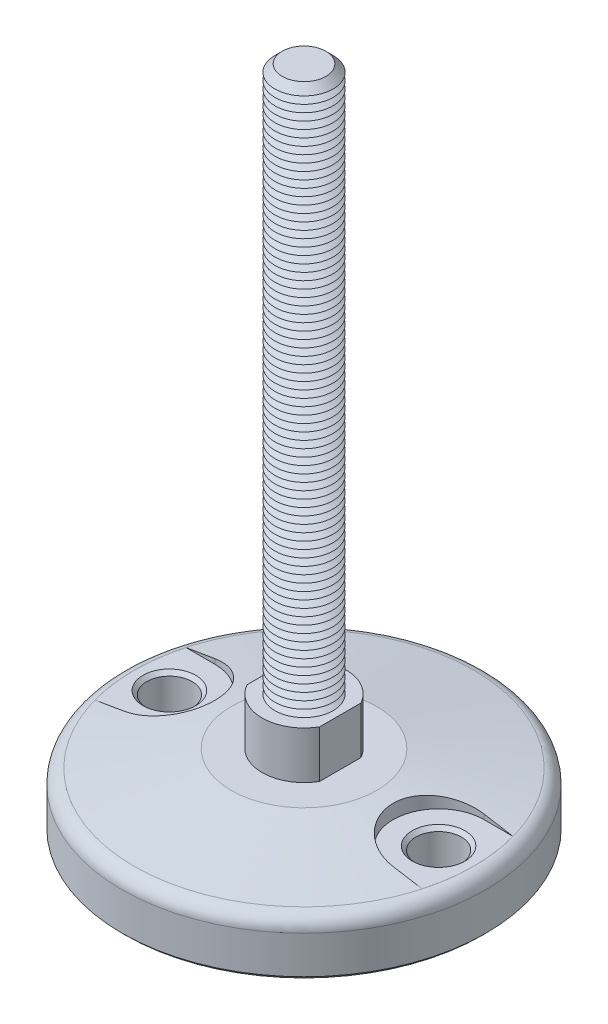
from build123d import *

# Parameters (mm, degrees)
FILLET1_R                = 4
SKETCH3_R                = 11.5
BOSS_EXTRUDE1_DEPTH      = 13
CUT_EXTRUDE1_START       = -13
CUT_EXTRUDE1_DEPTH       = 13
SKETCH5_R                = 8
BOSS_EXTRUDE2_DEPTH      = 150
CHAMFER1_SIZE            = 2
LPATTERN1_COUNT          = 74
LPATTERN1_PITCH          = 2
CUT_EXTRUDE4_DEPTH       = 4.7
SKETCH10_R               = 6.25
CUT_EXTRUDE5_DEPTH       = 15.3
CHAMFER2_SIZE            = 1
CHAMFER2_OF_MIRROR1_SIZE = 1
CHAMFER3_SIZE            = 1


with BuildPart() as part:
    # Sketch2 → Revolve1 (revolve)
    with BuildSketch(Plane(origin=(0, 0, 0), x_dir=(0, 0, -1), z_dir=(1, 0, 0))):
        Polygon((0, 0), (-20, 0), (-50, -5.289809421), (-50, -20), (0, -20), align=None)
    revolve(axis=Axis((0, 61.338865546, 0), (0, -1, 0)))

    # Fillet1
    fillet1_edges = [part.edges().sort_by_distance(p)[0] for p in [
        (0, -5.289809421, -50),
    ]]
    fillet(fillet1_edges, radius=FILLET1_R)

    # Sketch3 → Boss-Extrude1 (add)
    with BuildSketch(Plane(origin=(0, 0, 0), x_dir=(1, 0, 0), z_dir=(0, 1, 0))):
        with Locations(Location((0, 0, 0), (0, 0, 90))):
            Circle(SKETCH3_R)
    extrude(amount=BOSS_EXTRUDE1_DEPTH)

    # Sketch4 → Cut-Extrude1 (cut)
    with BuildSketch(Plane(origin=(0, 13, 0), x_dir=(1, 0, 0), z_dir=(0, 1, 0)).offset(CUT_EXTRUDE1_START)):
        with BuildLine():
            Line((-10, 5.678908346), (-10, -5.678908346))
            ThreePointArc((-10, -5.678908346), (-11.5, 0), (-10, 5.678908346))
        make_face()
        with BuildLine():
            Line((10, -5.678908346), (10, 5.678908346))
            ThreePointArc((10, 5.678908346), (11.5, 0), (10, -5.678908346))
        make_face()
    extrude(amount=CUT_EXTRUDE1_DEPTH, mode=Mode.SUBTRACT)

    # Sketch5 → Boss-Extrude2 (add)
    with BuildSketch(Plane(origin=(0, 13, 0), x_dir=(1, 0, 0), z_dir=(0, 1, 0))):
        with Locations(Location((0, 0, 0), (0, 0, 270))):
            Circle(SKETCH5_R)
    extrude(amount=BOSS_EXTRUDE2_DEPTH)

    # Chamfer1
    chamfer1_edges = [part.edges().sort_by_distance(p)[0] for p in [
        (0, 163, -8),
    ]]
    chamfer(chamfer1_edges, length=CHAMFER1_SIZE)

    # Sketch6 → Cut-Revolve1 (revolve, cut)
    with BuildSketch(Plane(origin=(0, 0, 0), x_dir=(0, 0, -1), z_dir=(1, 0, 0))):
        Polygon((-8, 13), (-6.267949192, 14), (-8, 15), align=None)
    cut_revolve1 = revolve(axis=Axis((0, 61.338865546, 0), (0, -1, 0)), mode=Mode.SUBTRACT)

    # LPattern1: Cut-Revolve1 ×74
    with Locations(*[(0, i * LPATTERN1_PITCH, 0) for i in range(1, LPATTERN1_COUNT)]):
        add(cut_revolve1, mode=Mode.SUBTRACT)

    # Sketch8 → Cut-Extrude4 (cut)
    with BuildSketch(Plane(origin=(0, 0, 0), x_dir=(1, 0, 0), z_dir=(0, 1, 0))):
        with BuildLine():
            Line((-37, 12.5), (-44.990387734, 12.5))
            ThreePointArc((-44.990387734, 12.5), (-46.694592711, 0), (-44.990387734, -12.5))
            Line((-44.990387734, -12.5), (-37, -12.5))
            ThreePointArc((-37, -12.5), (-24.5, 0), (-37, 12.5))
        make_face()
    cut_extrude4 = extrude(amount=-CUT_EXTRUDE4_DEPTH, mode=Mode.SUBTRACT)

    # Sketch10 → Cut-Extrude5 (cut)
    with BuildSketch(Plane(origin=(0, -4.7, 0), x_dir=(1, 0, 0), z_dir=(0, 1, 0))):
        with Locations(Location((-37, 0, 0), (0, 0, 270))):
            Circle(SKETCH10_R)
    cut_extrude5 = extrude(amount=-CUT_EXTRUDE5_DEPTH, mode=Mode.SUBTRACT)

    # Chamfer2
    chamfer2_edges = [part.edges().sort_by_distance(p)[0] for p in [
        (-37, -4.7, -6.25),
        (-37, -20, -6.25),
    ]]
    chamfer(chamfer2_edges, length=CHAMFER2_SIZE)

    # Mirror1: Cut-Extrude4, Cut-Extrude5 across plane
    add(cut_extrude4.mirror(Plane(origin=(0, 0, 0), x_dir=(0, 0, 1), z_dir=(1, 0, 0))), mode=Mode.SUBTRACT)
    add(cut_extrude5.mirror(Plane(origin=(0, 0, 0), x_dir=(0, 0, 1), z_dir=(1, 0, 0))), mode=Mode.SUBTRACT)

    # Chamfer2 of Mirror1
    chamfer2_of_mirror1_edges = [part.edges().sort_by_distance(p)[0] for p in [
        (37, -4.7, -6.25),
        (37, -20, -6.25),
    ]]
    chamfer(chamfer2_of_mirror1_edges, length=CHAMFER2_OF_MIRROR1_SIZE)

    # Chamfer3
    chamfer3_edges = [part.edges().sort_by_distance(p)[0] for p in [
        (0, -20, -50),
    ]]
    chamfer(chamfer3_edges, length=CHAMFER3_SIZE)


solid = part.part
